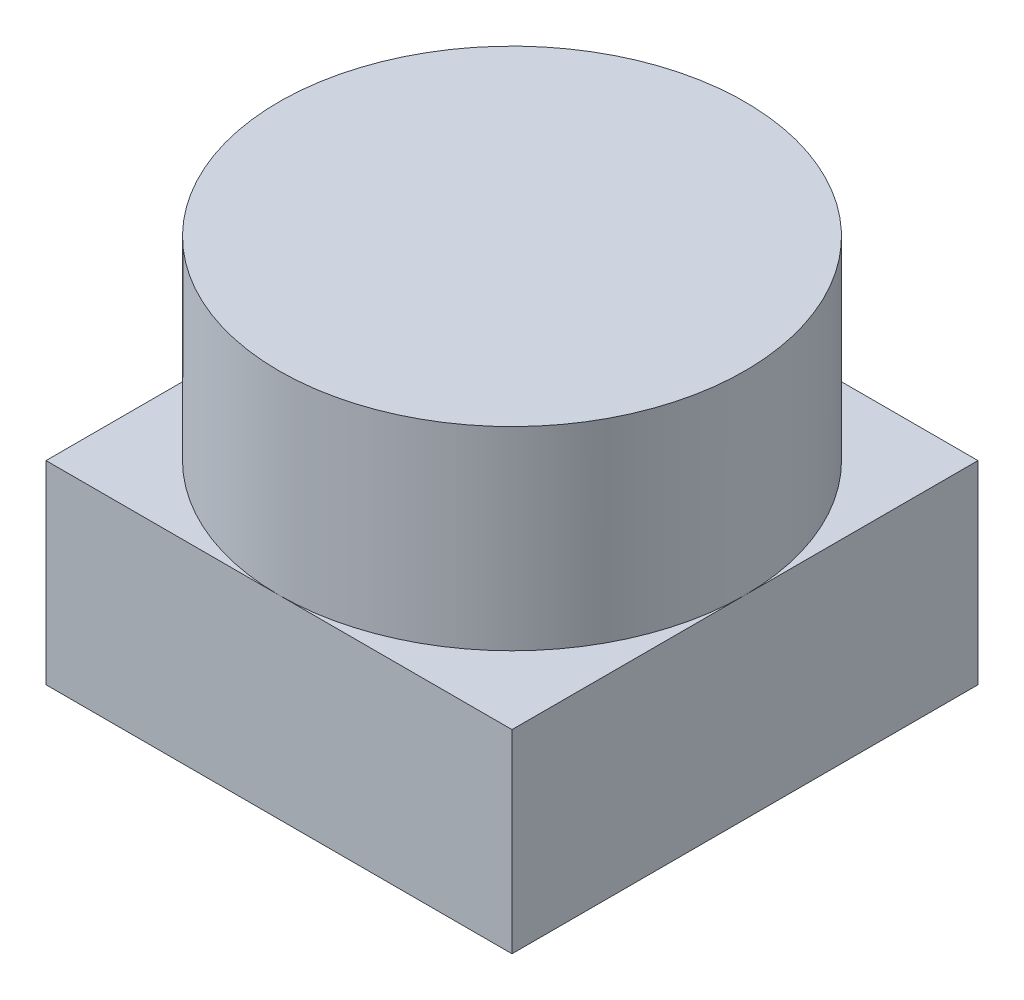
ISO-10303-21;
HEADER;
FILE_DESCRIPTION(('STEP AP214'),'2;1');
FILE_NAME('part.step','',(''),(''),'','','');
FILE_SCHEMA(('AUTOMOTIVE_DESIGN { 1 0 10303 214 1 1 1 1 }'));
ENDSEC;
DATA;
#1=APPLICATION_CONTEXT('core data for automotive mechanical design processes');
#2=APPLICATION_PROTOCOL_DEFINITION('international standard','automotive_design',2000,#1);
#3=PRODUCT_CONTEXT('',#1,'mechanical');
#4=PRODUCT('Part','Part','',(#3));
#5=PRODUCT_RELATED_PRODUCT_CATEGORY('part','',(#4));
#6=PRODUCT_DEFINITION_FORMATION('','',#4);
#7=PRODUCT_DEFINITION_CONTEXT('part definition',#1,'design');
#8=PRODUCT_DEFINITION('design','',#6,#7);
#9=PRODUCT_DEFINITION_SHAPE('','',#8);
#10=(LENGTH_UNIT() NAMED_UNIT(*) SI_UNIT(.MILLI.,.METRE.));
#11=(NAMED_UNIT(*) PLANE_ANGLE_UNIT() SI_UNIT($,.RADIAN.));
#12=(NAMED_UNIT(*) SI_UNIT($,.STERADIAN.) SOLID_ANGLE_UNIT());
#13=UNCERTAINTY_MEASURE_WITH_UNIT(LENGTH_MEASURE(1.E-05),#10,'distance_accuracy_value','');
#14=(GEOMETRIC_REPRESENTATION_CONTEXT(3) GLOBAL_UNCERTAINTY_ASSIGNED_CONTEXT((#13)) GLOBAL_UNIT_ASSIGNED_CONTEXT((#10,
#11,#12)) REPRESENTATION_CONTEXT('',''));
#15=CARTESIAN_POINT('',(0.,0.,0.));
#16=DIRECTION('',(0.,0.,1.));
#17=DIRECTION('',(1.,0.,0.));
#18=AXIS2_PLACEMENT_3D('',#15,#16,#17);
#19=CARTESIAN_POINT('',(0.,5.,0.));
#20=DIRECTION('',(0.,-1.,0.));
#21=DIRECTION('',(0.,0.,-1.));
#22=AXIS2_PLACEMENT_3D('',#19,#20,#21);
#23=PLANE('',#22);
#24=CARTESIAN_POINT('',(6.,5.,-6.));
#25=DIRECTION('',(0.,1.,0.));
#26=DIRECTION('',(0.,0.,1.));
#27=AXIS2_PLACEMENT_3D('',#24,#25,#26);
#28=CIRCLE('',#27,6.);
#29=CARTESIAN_POINT('',(6.,5.,0.));
#30=VERTEX_POINT('',#29);
#31=CARTESIAN_POINT('',(12.,5.,-6.));
#32=VERTEX_POINT('',#31);
#33=EDGE_CURVE('E48',#30,#32,#28,.T.);
#34=ORIENTED_EDGE('',*,*,#33,.F.);
#35=DIRECTION('',(1.,0.,0.));
#36=VECTOR('',#35,1.);
#37=CARTESIAN_POINT('',(0.,5.,0.));
#38=LINE('',#37,#36);
#39=CARTESIAN_POINT('',(12.,5.,0.));
#40=VERTEX_POINT('',#39);
#41=EDGE_CURVE('E102',#30,#40,#38,.T.);
#42=ORIENTED_EDGE('',*,*,#41,.T.);
#43=DIRECTION('',(0.,0.,-1.));
#44=VECTOR('',#43,1.);
#45=CARTESIAN_POINT('',(12.,5.,0.));
#46=LINE('',#45,#44);
#47=EDGE_CURVE('E114',#40,#32,#46,.T.);
#48=ORIENTED_EDGE('',*,*,#47,.T.);
#49=EDGE_LOOP('',(#34,#42,#48));
#50=FACE_BOUND('',#49,.T.);
#51=ADVANCED_FACE('F37',(#50),#23,.F.);
#52=CARTESIAN_POINT('',(6.,5.,-12.));
#53=VERTEX_POINT('',#52);
#54=EDGE_CURVE('E11',#32,#53,#28,.T.);
#55=ORIENTED_EDGE('',*,*,#54,.F.);
#56=CARTESIAN_POINT('',(12.,5.,-12.));
#57=VERTEX_POINT('',#56);
#58=EDGE_CURVE('E101',#32,#57,#46,.T.);
#59=ORIENTED_EDGE('',*,*,#58,.T.);
#60=DIRECTION('',(-1.,0.,0.));
#61=VECTOR('',#60,1.);
#62=CARTESIAN_POINT('',(0.,5.,-12.));
#63=LINE('',#62,#61);
#64=EDGE_CURVE('E123',#57,#53,#63,.T.);
#65=ORIENTED_EDGE('',*,*,#64,.T.);
#66=EDGE_LOOP('',(#55,#59,#65));
#67=FACE_BOUND('',#66,.T.);
#68=ADVANCED_FACE('F154',(#67),#23,.F.);
#69=CARTESIAN_POINT('',(0.,5.,-6.));
#70=VERTEX_POINT('',#69);
#71=EDGE_CURVE('E46',#53,#70,#28,.T.);
#72=ORIENTED_EDGE('',*,*,#71,.F.);
#73=CARTESIAN_POINT('',(0.,5.,-12.));
#74=VERTEX_POINT('',#73);
#75=EDGE_CURVE('E122',#53,#74,#63,.T.);
#76=ORIENTED_EDGE('',*,*,#75,.T.);
#77=DIRECTION('',(0.,0.,1.));
#78=VECTOR('',#77,1.);
#79=CARTESIAN_POINT('',(0.,5.,0.));
#80=LINE('',#79,#78);
#81=EDGE_CURVE('E112',#74,#70,#80,.T.);
#82=ORIENTED_EDGE('',*,*,#81,.T.);
#83=EDGE_LOOP('',(#72,#76,#82));
#84=FACE_BOUND('',#83,.T.);
#85=ADVANCED_FACE('F153',(#84),#23,.F.);
#86=CARTESIAN_POINT('',(0.,5.,0.));
#87=DIRECTION('',(1.,0.,0.));
#88=DIRECTION('',(0.,0.,-1.));
#89=AXIS2_PLACEMENT_3D('',#86,#87,#88);
#90=PLANE('',#89);
#91=DIRECTION('',(0.,0.,1.));
#92=VECTOR('',#91,1.);
#93=CARTESIAN_POINT('',(0.,0.,0.));
#94=LINE('',#93,#92);
#95=CARTESIAN_POINT('',(0.,0.,-12.));
#96=VERTEX_POINT('',#95);
#97=CARTESIAN_POINT('',(0.,0.,0.));
#98=VERTEX_POINT('',#97);
#99=EDGE_CURVE('E126',#96,#98,#94,.T.);
#100=ORIENTED_EDGE('',*,*,#99,.T.);
#101=DIRECTION('',(0.,-1.,0.));
#102=VECTOR('',#101,1.);
#103=CARTESIAN_POINT('',(0.,5.,0.));
#104=LINE('',#103,#102);
#105=CARTESIAN_POINT('',(0.,5.,0.));
#106=VERTEX_POINT('',#105);
#107=EDGE_CURVE('E41',#106,#98,#104,.T.);
#108=ORIENTED_EDGE('',*,*,#107,.F.);
#109=EDGE_CURVE('E97',#70,#106,#80,.T.);
#110=ORIENTED_EDGE('',*,*,#109,.F.);
#111=ORIENTED_EDGE('',*,*,#81,.F.);
#112=DIRECTION('',(0.,-1.,0.));
#113=VECTOR('',#112,1.);
#114=CARTESIAN_POINT('',(0.,5.,-12.));
#115=LINE('',#114,#113);
#116=EDGE_CURVE('E125',#74,#96,#115,.T.);
#117=ORIENTED_EDGE('',*,*,#116,.T.);
#118=EDGE_LOOP('',(#100,#108,#110,#111,#117));
#119=FACE_BOUND('',#118,.T.);
#120=ADVANCED_FACE('F39',(#119),#90,.F.);
#121=CARTESIAN_POINT('',(0.,5.,0.));
#122=DIRECTION('',(0.,0.,-1.));
#123=DIRECTION('',(-1.,0.,0.));
#124=AXIS2_PLACEMENT_3D('',#121,#122,#123);
#125=PLANE('',#124);
#126=DIRECTION('',(1.,0.,0.));
#127=VECTOR('',#126,1.);
#128=CARTESIAN_POINT('',(0.,0.,0.));
#129=LINE('',#128,#127);
#130=CARTESIAN_POINT('',(12.,0.,0.));
#131=VERTEX_POINT('',#130);
#132=EDGE_CURVE('E129',#98,#131,#129,.T.);
#133=ORIENTED_EDGE('',*,*,#132,.T.);
#134=DIRECTION('',(0.,-1.,0.));
#135=VECTOR('',#134,1.);
#136=CARTESIAN_POINT('',(12.,5.,0.));
#137=LINE('',#136,#135);
#138=EDGE_CURVE('E108',#40,#131,#137,.T.);
#139=ORIENTED_EDGE('',*,*,#138,.F.);
#140=ORIENTED_EDGE('',*,*,#41,.F.);
#141=EDGE_CURVE('E91',#106,#30,#38,.T.);
#142=ORIENTED_EDGE('',*,*,#141,.F.);
#143=ORIENTED_EDGE('',*,*,#107,.T.);
#144=EDGE_LOOP('',(#133,#139,#140,#142,#143));
#145=FACE_BOUND('',#144,.T.);
#146=ADVANCED_FACE('F106',(#145),#125,.F.);
#147=CARTESIAN_POINT('',(12.,5.,0.));
#148=DIRECTION('',(-1.,0.,0.));
#149=DIRECTION('',(0.,0.,1.));
#150=AXIS2_PLACEMENT_3D('',#147,#148,#149);
#151=PLANE('',#150);
#152=DIRECTION('',(0.,0.,-1.));
#153=VECTOR('',#152,1.);
#154=CARTESIAN_POINT('',(12.,0.,0.));
#155=LINE('',#154,#153);
#156=CARTESIAN_POINT('',(12.,0.,-12.));
#157=VERTEX_POINT('',#156);
#158=EDGE_CURVE('E131',#131,#157,#155,.T.);
#159=ORIENTED_EDGE('',*,*,#158,.T.);
#160=DIRECTION('',(0.,-1.,0.));
#161=VECTOR('',#160,1.);
#162=CARTESIAN_POINT('',(12.,5.,-12.));
#163=LINE('',#162,#161);
#164=EDGE_CURVE('E137',#57,#157,#163,.T.);
#165=ORIENTED_EDGE('',*,*,#164,.F.);
#166=ORIENTED_EDGE('',*,*,#58,.F.);
#167=ORIENTED_EDGE('',*,*,#47,.F.);
#168=ORIENTED_EDGE('',*,*,#138,.T.);
#169=EDGE_LOOP('',(#159,#165,#166,#167,#168));
#170=FACE_BOUND('',#169,.T.);
#171=ADVANCED_FACE('F141',(#170),#151,.F.);
#172=CARTESIAN_POINT('',(0.,5.,-12.));
#173=DIRECTION('',(0.,0.,1.));
#174=DIRECTION('',(1.,0.,0.));
#175=AXIS2_PLACEMENT_3D('',#172,#173,#174);
#176=PLANE('',#175);
#177=DIRECTION('',(-1.,0.,0.));
#178=VECTOR('',#177,1.);
#179=CARTESIAN_POINT('',(0.,0.,-12.));
#180=LINE('',#179,#178);
#181=EDGE_CURVE('E133',#157,#96,#180,.T.);
#182=ORIENTED_EDGE('',*,*,#181,.T.);
#183=ORIENTED_EDGE('',*,*,#116,.F.);
#184=ORIENTED_EDGE('',*,*,#75,.F.);
#185=ORIENTED_EDGE('',*,*,#64,.F.);
#186=ORIENTED_EDGE('',*,*,#164,.T.);
#187=EDGE_LOOP('',(#182,#183,#184,#185,#186));
#188=FACE_BOUND('',#187,.T.);
#189=ADVANCED_FACE('F149',(#188),#176,.F.);
#190=EDGE_CURVE('E95',#70,#30,#28,.T.);
#191=ORIENTED_EDGE('',*,*,#190,.F.);
#192=ORIENTED_EDGE('',*,*,#109,.T.);
#193=ORIENTED_EDGE('',*,*,#141,.T.);
#194=EDGE_LOOP('',(#191,#192,#193));
#195=FACE_BOUND('',#194,.T.);
#196=ADVANCED_FACE('F93',(#195),#23,.F.);
#197=CARTESIAN_POINT('',(0.,0.,0.));
#198=DIRECTION('',(0.,-1.,0.));
#199=DIRECTION('',(0.,0.,-1.));
#200=AXIS2_PLACEMENT_3D('',#197,#198,#199);
#201=PLANE('',#200);
#202=ORIENTED_EDGE('',*,*,#99,.F.);
#203=ORIENTED_EDGE('',*,*,#181,.F.);
#204=ORIENTED_EDGE('',*,*,#158,.F.);
#205=ORIENTED_EDGE('',*,*,#132,.F.);
#206=EDGE_LOOP('',(#202,#203,#204,#205));
#207=FACE_BOUND('',#206,.T.);
#208=ADVANCED_FACE('F146',(#207),#201,.T.);
#209=CARTESIAN_POINT('',(6.,10.,-6.));
#210=DIRECTION('',(0.,-1.,0.));
#211=DIRECTION('',(0.,0.,-1.));
#212=AXIS2_PLACEMENT_3D('',#209,#210,#211);
#213=CYLINDRICAL_SURFACE('',#212,6.);
#214=CARTESIAN_POINT('',(6.,10.,-6.));
#215=DIRECTION('',(0.,1.,0.));
#216=DIRECTION('',(0.,0.,1.));
#217=AXIS2_PLACEMENT_3D('',#214,#215,#216);
#218=CIRCLE('',#217,6.);
#219=CARTESIAN_POINT('',(6.,10.,0.));
#220=VERTEX_POINT('',#219);
#221=EDGE_CURVE('E116',#220,#220,#218,.T.);
#222=ORIENTED_EDGE('',*,*,#221,.F.);
#223=EDGE_LOOP('',(#222));
#224=FACE_BOUND('',#223,.T.);
#225=ORIENTED_EDGE('',*,*,#33,.T.);
#226=ORIENTED_EDGE('',*,*,#54,.T.);
#227=ORIENTED_EDGE('',*,*,#71,.T.);
#228=ORIENTED_EDGE('',*,*,#190,.T.);
#229=EDGE_LOOP('',(#225,#226,#227,#228));
#230=FACE_BOUND('',#229,.T.);
#231=ADVANCED_FACE('F117',(#224,#230),#213,.T.);
#232=CARTESIAN_POINT('',(6.,10.,-6.));
#233=DIRECTION('',(0.,1.,0.));
#234=DIRECTION('',(0.,0.,1.));
#235=AXIS2_PLACEMENT_3D('',#232,#233,#234);
#236=PLANE('',#235);
#237=ORIENTED_EDGE('',*,*,#221,.T.);
#238=EDGE_LOOP('',(#237));
#239=FACE_BOUND('',#238,.T.);
#240=ADVANCED_FACE('F210',(#239),#236,.T.);
#241=CLOSED_SHELL('',(#51,#68,#85,#120,#146,#171,#189,#196,#208,#231,#240));
#242=MANIFOLD_SOLID_BREP('B2',#241);
#243=ADVANCED_BREP_SHAPE_REPRESENTATION('',(#18,#242),#14);
#244=SHAPE_DEFINITION_REPRESENTATION(#9,#243);
ENDSEC;
END-ISO-10303-21;
